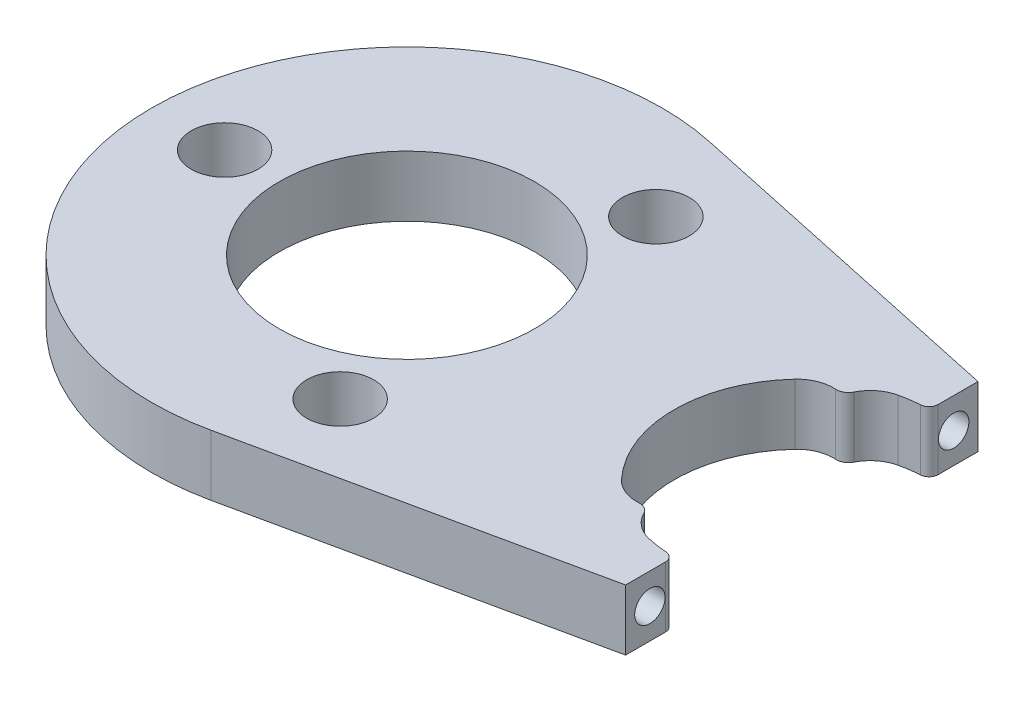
ISO-10303-21;
HEADER;
FILE_DESCRIPTION(('STEP AP214'),'2;1');
FILE_NAME('part.step','',(''),(''),'','','');
FILE_SCHEMA(('AUTOMOTIVE_DESIGN { 1 0 10303 214 1 1 1 1 }'));
ENDSEC;
DATA;
#1=APPLICATION_CONTEXT('core data for automotive mechanical design processes');
#2=APPLICATION_PROTOCOL_DEFINITION('international standard','automotive_design',2000,#1);
#3=PRODUCT_CONTEXT('',#1,'mechanical');
#4=PRODUCT('Part','Part','',(#3));
#5=PRODUCT_RELATED_PRODUCT_CATEGORY('part','',(#4));
#6=PRODUCT_DEFINITION_FORMATION('','',#4);
#7=PRODUCT_DEFINITION_CONTEXT('part definition',#1,'design');
#8=PRODUCT_DEFINITION('design','',#6,#7);
#9=PRODUCT_DEFINITION_SHAPE('','',#8);
#10=(LENGTH_UNIT() NAMED_UNIT(*) SI_UNIT(.MILLI.,.METRE.));
#11=(NAMED_UNIT(*) PLANE_ANGLE_UNIT() SI_UNIT($,.RADIAN.));
#12=(NAMED_UNIT(*) SI_UNIT($,.STERADIAN.) SOLID_ANGLE_UNIT());
#13=UNCERTAINTY_MEASURE_WITH_UNIT(LENGTH_MEASURE(1.E-05),#10,'distance_accuracy_value','');
#14=(GEOMETRIC_REPRESENTATION_CONTEXT(3) GLOBAL_UNCERTAINTY_ASSIGNED_CONTEXT((#13)) GLOBAL_UNIT_ASSIGNED_CONTEXT((#10,
#11,#12)) REPRESENTATION_CONTEXT('',''));
#15=CARTESIAN_POINT('',(0.,0.,0.));
#16=DIRECTION('',(0.,0.,1.));
#17=DIRECTION('',(1.,0.,0.));
#18=AXIS2_PLACEMENT_3D('',#15,#16,#17);
#19=CARTESIAN_POINT('',(32.5,2.5,0.));
#20=DIRECTION('',(0.,1.,0.));
#21=DIRECTION('',(0.,0.,1.));
#22=AXIS2_PLACEMENT_3D('',#19,#20,#21);
#23=PLANE('',#22);
#24=CARTESIAN_POINT('',(7.49999999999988,2.5,-12.9903810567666));
#25=DIRECTION('',(0.,1.,0.));
#26=DIRECTION('',(0.,0.,1.));
#27=AXIS2_PLACEMENT_3D('',#24,#25,#26);
#28=CIRCLE('',#27,2.75);
#29=CARTESIAN_POINT('',(7.49999999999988,2.5,-10.2403810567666));
#30=VERTEX_POINT('',#29);
#31=EDGE_CURVE('E610',#30,#30,#28,.T.);
#32=ORIENTED_EDGE('',*,*,#31,.F.);
#33=EDGE_LOOP('',(#32));
#34=FACE_BOUND('',#33,.T.);
#35=CARTESIAN_POINT('',(7.50000000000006,2.5,12.9903810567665));
#36=DIRECTION('',(0.,1.,0.));
#37=DIRECTION('',(0.,0.,1.));
#38=AXIS2_PLACEMENT_3D('',#35,#36,#37);
#39=CIRCLE('',#38,2.75);
#40=CARTESIAN_POINT('',(7.50000000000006,2.5,15.7403810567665));
#41=VERTEX_POINT('',#40);
#42=EDGE_CURVE('E612',#41,#41,#39,.T.);
#43=ORIENTED_EDGE('',*,*,#42,.F.);
#44=EDGE_LOOP('',(#43));
#45=FACE_BOUND('',#44,.T.);
#46=CARTESIAN_POINT('',(-15.,2.5,0.));
#47=DIRECTION('',(0.,1.,0.));
#48=DIRECTION('',(0.,0.,1.));
#49=AXIS2_PLACEMENT_3D('',#46,#47,#48);
#50=CIRCLE('',#49,2.75);
#51=CARTESIAN_POINT('',(-15.,2.5,2.75));
#52=VERTEX_POINT('',#51);
#53=EDGE_CURVE('E620',#52,#52,#50,.T.);
#54=ORIENTED_EDGE('',*,*,#53,.F.);
#55=EDGE_LOOP('',(#54));
#56=FACE_BOUND('',#55,.T.);
#57=CARTESIAN_POINT('',(27.25,2.5,-9.09326673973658));
#58=DIRECTION('',(0.,1.,0.));
#59=DIRECTION('',(0.,0.,1.));
#60=AXIS2_PLACEMENT_3D('',#57,#58,#59);
#61=CIRCLE('',#60,0.999999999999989);
#62=CARTESIAN_POINT('',(27.1879531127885,2.5,-8.09519350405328));
#63=VERTEX_POINT('',#62);
#64=CARTESIAN_POINT('',(28.1453802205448,2.5,-8.64796430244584));
#65=VERTEX_POINT('',#64);
#66=EDGE_CURVE('E193',#63,#65,#61,.T.);
#67=ORIENTED_EDGE('',*,*,#66,.T.);
#68=CARTESIAN_POINT('',(30.8315208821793,2.5,-7.3120569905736));
#69=DIRECTION('',(0.,1.,0.));
#70=DIRECTION('',(0.,0.,1.));
#71=AXIS2_PLACEMENT_3D('',#68,#69,#70);
#72=CIRCLE('',#71,3.);
#73=CARTESIAN_POINT('',(30.164129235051,2.5,-10.236879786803));
#74=VERTEX_POINT('',#73);
#75=EDGE_CURVE('E11',#65,#74,#72,.F.);
#76=ORIENTED_EDGE('',*,*,#75,.T.);
#77=CARTESIAN_POINT('',(32.5,2.5,0.));
#78=DIRECTION('',(0.,-1.,0.));
#79=DIRECTION('',(0.,0.,1.));
#80=AXIS2_PLACEMENT_3D('',#77,#78,#79);
#81=CIRCLE('',#80,10.5);
#82=CARTESIAN_POINT('',(31.8,2.5,-10.476640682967));
#83=VERTEX_POINT('',#82);
#84=EDGE_CURVE('E195',#74,#83,#81,.T.);
#85=ORIENTED_EDGE('',*,*,#84,.T.);
#86=CARTESIAN_POINT('',(31.75,2.5,-11.2249721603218));
#87=DIRECTION('',(0.,1.,0.));
#88=DIRECTION('',(0.,0.,1.));
#89=AXIS2_PLACEMENT_3D('',#86,#87,#88);
#90=CIRCLE('',#89,0.75);
#91=CARTESIAN_POINT('',(32.5,2.5,-11.2249721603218));
#92=VERTEX_POINT('',#91);
#93=EDGE_CURVE('E256',#83,#92,#90,.T.);
#94=ORIENTED_EDGE('',*,*,#93,.T.);
#95=DIRECTION('',(0.,0.,-1.));
#96=VECTOR('',#95,1.);
#97=CARTESIAN_POINT('',(32.5,2.5,-10.5));
#98=LINE('',#97,#96);
#99=CARTESIAN_POINT('',(32.5,2.5,-14.5));
#100=VERTEX_POINT('',#99);
#101=EDGE_CURVE('E197',#92,#100,#98,.T.);
#102=ORIENTED_EDGE('',*,*,#101,.T.);
#103=DIRECTION('',(-0.97771359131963,0.,-0.209943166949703));
#104=VECTOR('',#103,1.);
#105=CARTESIAN_POINT('',(4.40880650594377,2.5,-20.5319854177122));
#106=LINE('',#105,#104);
#107=CARTESIAN_POINT('',(4.40880650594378,2.5,-20.5319854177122));
#108=VERTEX_POINT('',#107);
#109=EDGE_CURVE('E199',#100,#108,#106,.T.);
#110=ORIENTED_EDGE('',*,*,#109,.T.);
#111=CARTESIAN_POINT('',(0.,2.5,0.));
#112=DIRECTION('',(0.,1.,0.));
#113=DIRECTION('',(0.,0.,1.));
#114=AXIS2_PLACEMENT_3D('',#111,#112,#113);
#115=CIRCLE('',#114,21.);
#116=CARTESIAN_POINT('',(4.40880650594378,2.5,20.5319854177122));
#117=VERTEX_POINT('',#116);
#118=EDGE_CURVE('E201',#108,#117,#115,.T.);
#119=ORIENTED_EDGE('',*,*,#118,.T.);
#120=DIRECTION('',(0.97771359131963,0.,-0.209943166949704));
#121=VECTOR('',#120,1.);
#122=CARTESIAN_POINT('',(32.5,2.5,14.5));
#123=LINE('',#122,#121);
#124=CARTESIAN_POINT('',(32.5,2.5,14.5));
#125=VERTEX_POINT('',#124);
#126=EDGE_CURVE('E203',#117,#125,#123,.T.);
#127=ORIENTED_EDGE('',*,*,#126,.T.);
#128=DIRECTION('',(0.,0.,-1.));
#129=VECTOR('',#128,1.);
#130=CARTESIAN_POINT('',(32.5,2.5,10.5));
#131=LINE('',#130,#129);
#132=CARTESIAN_POINT('',(32.5,2.5,11.2249721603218));
#133=VERTEX_POINT('',#132);
#134=EDGE_CURVE('E205',#125,#133,#131,.T.);
#135=ORIENTED_EDGE('',*,*,#134,.T.);
#136=CARTESIAN_POINT('',(31.75,2.5,11.2249721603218));
#137=DIRECTION('',(0.,1.,0.));
#138=DIRECTION('',(0.,0.,1.));
#139=AXIS2_PLACEMENT_3D('',#136,#137,#138);
#140=CIRCLE('',#139,0.75);
#141=CARTESIAN_POINT('',(31.8,2.5,10.476640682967));
#142=VERTEX_POINT('',#141);
#143=EDGE_CURVE('E254',#133,#142,#140,.T.);
#144=ORIENTED_EDGE('',*,*,#143,.T.);
#145=CARTESIAN_POINT('',(32.5,2.5,0.));
#146=DIRECTION('',(0.,-1.,0.));
#147=DIRECTION('',(0.,0.,1.));
#148=AXIS2_PLACEMENT_3D('',#145,#146,#147);
#149=CIRCLE('',#148,10.5);
#150=CARTESIAN_POINT('',(30.164129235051,2.5,10.236879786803));
#151=VERTEX_POINT('',#150);
#152=EDGE_CURVE('E183',#142,#151,#149,.T.);
#153=ORIENTED_EDGE('',*,*,#152,.T.);
#154=CARTESIAN_POINT('',(30.8315208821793,2.5,7.3120569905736));
#155=DIRECTION('',(0.,1.,0.));
#156=DIRECTION('',(0.,0.,1.));
#157=AXIS2_PLACEMENT_3D('',#154,#155,#156);
#158=CIRCLE('',#157,3.);
#159=CARTESIAN_POINT('',(28.1453802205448,2.5,8.64796430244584));
#160=VERTEX_POINT('',#159);
#161=EDGE_CURVE('E288',#151,#160,#158,.F.);
#162=ORIENTED_EDGE('',*,*,#161,.T.);
#163=CARTESIAN_POINT('',(27.25,2.5,9.09326673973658));
#164=DIRECTION('',(0.,1.,0.));
#165=DIRECTION('',(0.,0.,1.));
#166=AXIS2_PLACEMENT_3D('',#163,#164,#165);
#167=CIRCLE('',#166,0.999999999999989);
#168=CARTESIAN_POINT('',(27.1879531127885,2.5,8.09519350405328));
#169=VERTEX_POINT('',#168);
#170=EDGE_CURVE('E186',#160,#169,#167,.T.);
#171=ORIENTED_EDGE('',*,*,#170,.T.);
#172=CARTESIAN_POINT('',(27.001812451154,2.5,5.10097379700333));
#173=DIRECTION('',(0.,1.,0.));
#174=DIRECTION('',(0.,0.,1.));
#175=AXIS2_PLACEMENT_3D('',#172,#173,#174);
#176=CIRCLE('',#175,3.);
#177=CARTESIAN_POINT('',(24.8025374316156,2.5,7.14136331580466));
#178=VERTEX_POINT('',#177);
#179=EDGE_CURVE('E284',#169,#178,#176,.F.);
#180=ORIENTED_EDGE('',*,*,#179,.T.);
#181=CARTESIAN_POINT('',(32.5,2.5,0.));
#182=DIRECTION('',(0.,-1.,0.));
#183=DIRECTION('',(0.,0.,1.));
#184=AXIS2_PLACEMENT_3D('',#181,#182,#183);
#185=CIRCLE('',#184,10.5);
#186=CARTESIAN_POINT('',(24.8025374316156,2.5,-7.14136331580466));
#187=VERTEX_POINT('',#186);
#188=EDGE_CURVE('E190',#178,#187,#185,.T.);
#189=ORIENTED_EDGE('',*,*,#188,.T.);
#190=CARTESIAN_POINT('',(27.001812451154,2.5,-5.10097379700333));
#191=DIRECTION('',(0.,1.,0.));
#192=DIRECTION('',(0.,0.,1.));
#193=AXIS2_PLACEMENT_3D('',#190,#191,#192);
#194=CIRCLE('',#193,3.);
#195=EDGE_CURVE('E292',#187,#63,#194,.F.);
#196=ORIENTED_EDGE('',*,*,#195,.T.);
#197=EDGE_LOOP('',(#67,#76,#85,#94,#102,#110,#119,#127,#135,#144,#153,#162,#171,#180,#189,#196));
#198=FACE_BOUND('',#197,.T.);
#199=CARTESIAN_POINT('',(0.,2.5,0.));
#200=DIRECTION('',(0.,1.,0.));
#201=DIRECTION('',(0.,0.,1.));
#202=AXIS2_PLACEMENT_3D('',#199,#200,#201);
#203=CIRCLE('',#202,10.5);
#204=CARTESIAN_POINT('',(0.,2.5,10.5));
#205=VERTEX_POINT('',#204);
#206=EDGE_CURVE('E177',#205,#205,#203,.T.);
#207=ORIENTED_EDGE('',*,*,#206,.F.);
#208=EDGE_LOOP('',(#207));
#209=FACE_BOUND('',#208,.T.);
#210=ADVANCED_FACE('F37',(#34,#45,#56,#198,#209),#23,.T.);
#211=CARTESIAN_POINT('',(32.5,-2.5,0.));
#212=DIRECTION('',(0.,1.,0.));
#213=DIRECTION('',(0.,0.,1.));
#214=AXIS2_PLACEMENT_3D('',#211,#212,#213);
#215=PLANE('',#214);
#216=CARTESIAN_POINT('',(7.49999999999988,-2.5,-12.9903810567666));
#217=DIRECTION('',(0.,1.,0.));
#218=DIRECTION('',(0.,0.,1.));
#219=AXIS2_PLACEMENT_3D('',#216,#217,#218);
#220=CIRCLE('',#219,2.75);
#221=CARTESIAN_POINT('',(7.49999999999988,-2.5,-10.2403810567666));
#222=VERTEX_POINT('',#221);
#223=EDGE_CURVE('E608',#222,#222,#220,.T.);
#224=ORIENTED_EDGE('',*,*,#223,.T.);
#225=EDGE_LOOP('',(#224));
#226=FACE_BOUND('',#225,.T.);
#227=CARTESIAN_POINT('',(7.50000000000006,-2.5,12.9903810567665));
#228=DIRECTION('',(0.,1.,0.));
#229=DIRECTION('',(0.,0.,1.));
#230=AXIS2_PLACEMENT_3D('',#227,#228,#229);
#231=CIRCLE('',#230,2.75);
#232=CARTESIAN_POINT('',(7.50000000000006,-2.5,15.7403810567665));
#233=VERTEX_POINT('',#232);
#234=EDGE_CURVE('E617',#233,#233,#231,.T.);
#235=ORIENTED_EDGE('',*,*,#234,.T.);
#236=EDGE_LOOP('',(#235));
#237=FACE_BOUND('',#236,.T.);
#238=CARTESIAN_POINT('',(-15.,-2.5,0.));
#239=DIRECTION('',(0.,1.,0.));
#240=DIRECTION('',(0.,0.,1.));
#241=AXIS2_PLACEMENT_3D('',#238,#239,#240);
#242=CIRCLE('',#241,2.75);
#243=CARTESIAN_POINT('',(-15.,-2.5,2.75));
#244=VERTEX_POINT('',#243);
#245=EDGE_CURVE('E170',#244,#244,#242,.T.);
#246=ORIENTED_EDGE('',*,*,#245,.T.);
#247=EDGE_LOOP('',(#246));
#248=FACE_BOUND('',#247,.T.);
#249=DIRECTION('',(0.,0.,-1.));
#250=VECTOR('',#249,1.);
#251=CARTESIAN_POINT('',(32.5,-2.5,-10.5));
#252=LINE('',#251,#250);
#253=CARTESIAN_POINT('',(32.5,-2.5,-11.2249721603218));
#254=VERTEX_POINT('',#253);
#255=CARTESIAN_POINT('',(32.5,-2.5,-14.5));
#256=VERTEX_POINT('',#255);
#257=EDGE_CURVE('E222',#254,#256,#252,.T.);
#258=ORIENTED_EDGE('',*,*,#257,.F.);
#259=CARTESIAN_POINT('',(31.75,-2.5,-11.2249721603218));
#260=DIRECTION('',(0.,1.,0.));
#261=DIRECTION('',(0.,0.,1.));
#262=AXIS2_PLACEMENT_3D('',#259,#260,#261);
#263=CIRCLE('',#262,0.75);
#264=CARTESIAN_POINT('',(31.8,-2.5,-10.476640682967));
#265=VERTEX_POINT('',#264);
#266=EDGE_CURVE('E248',#254,#265,#263,.F.);
#267=ORIENTED_EDGE('',*,*,#266,.T.);
#268=CARTESIAN_POINT('',(32.5,-2.5,0.));
#269=DIRECTION('',(0.,-1.,0.));
#270=DIRECTION('',(0.,0.,1.));
#271=AXIS2_PLACEMENT_3D('',#268,#269,#270);
#272=CIRCLE('',#271,10.5);
#273=CARTESIAN_POINT('',(30.164129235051,-2.5,-10.236879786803));
#274=VERTEX_POINT('',#273);
#275=EDGE_CURVE('E220',#274,#265,#272,.T.);
#276=ORIENTED_EDGE('',*,*,#275,.F.);
#277=CARTESIAN_POINT('',(30.8315208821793,-2.5,-7.3120569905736));
#278=DIRECTION('',(0.,1.,0.));
#279=DIRECTION('',(0.,0.,1.));
#280=AXIS2_PLACEMENT_3D('',#277,#278,#279);
#281=CIRCLE('',#280,3.);
#282=CARTESIAN_POINT('',(28.1453802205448,-2.5,-8.64796430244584));
#283=VERTEX_POINT('',#282);
#284=EDGE_CURVE('E45',#274,#283,#281,.T.);
#285=ORIENTED_EDGE('',*,*,#284,.T.);
#286=CARTESIAN_POINT('',(27.25,-2.5,-9.09326673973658));
#287=DIRECTION('',(0.,1.,0.));
#288=DIRECTION('',(0.,0.,1.));
#289=AXIS2_PLACEMENT_3D('',#286,#287,#288);
#290=CIRCLE('',#289,0.999999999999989);
#291=CARTESIAN_POINT('',(27.1879531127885,-2.5,-8.09519350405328));
#292=VERTEX_POINT('',#291);
#293=EDGE_CURVE('E217',#292,#283,#290,.T.);
#294=ORIENTED_EDGE('',*,*,#293,.F.);
#295=CARTESIAN_POINT('',(27.001812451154,-2.5,-5.10097379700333));
#296=DIRECTION('',(0.,1.,0.));
#297=DIRECTION('',(0.,0.,1.));
#298=AXIS2_PLACEMENT_3D('',#295,#296,#297);
#299=CIRCLE('',#298,3.);
#300=CARTESIAN_POINT('',(24.8025374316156,-2.5,-7.14136331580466));
#301=VERTEX_POINT('',#300);
#302=EDGE_CURVE('E290',#292,#301,#299,.T.);
#303=ORIENTED_EDGE('',*,*,#302,.T.);
#304=CARTESIAN_POINT('',(32.5,-2.5,0.));
#305=DIRECTION('',(0.,-1.,0.));
#306=DIRECTION('',(0.,0.,1.));
#307=AXIS2_PLACEMENT_3D('',#304,#305,#306);
#308=CIRCLE('',#307,10.5);
#309=CARTESIAN_POINT('',(24.8025374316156,-2.5,7.14136331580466));
#310=VERTEX_POINT('',#309);
#311=EDGE_CURVE('E214',#310,#301,#308,.T.);
#312=ORIENTED_EDGE('',*,*,#311,.F.);
#313=CARTESIAN_POINT('',(27.001812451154,-2.5,5.10097379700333));
#314=DIRECTION('',(0.,1.,0.));
#315=DIRECTION('',(0.,0.,1.));
#316=AXIS2_PLACEMENT_3D('',#313,#314,#315);
#317=CIRCLE('',#316,3.);
#318=CARTESIAN_POINT('',(27.1879531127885,-2.5,8.09519350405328));
#319=VERTEX_POINT('',#318);
#320=EDGE_CURVE('E282',#310,#319,#317,.T.);
#321=ORIENTED_EDGE('',*,*,#320,.T.);
#322=CARTESIAN_POINT('',(27.25,-2.5,9.09326673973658));
#323=DIRECTION('',(0.,1.,0.));
#324=DIRECTION('',(0.,0.,1.));
#325=AXIS2_PLACEMENT_3D('',#322,#323,#324);
#326=CIRCLE('',#325,0.999999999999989);
#327=CARTESIAN_POINT('',(28.1453802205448,-2.5,8.64796430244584));
#328=VERTEX_POINT('',#327);
#329=EDGE_CURVE('E211',#328,#319,#326,.T.);
#330=ORIENTED_EDGE('',*,*,#329,.F.);
#331=CARTESIAN_POINT('',(30.8315208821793,-2.5,7.3120569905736));
#332=DIRECTION('',(0.,1.,0.));
#333=DIRECTION('',(0.,0.,1.));
#334=AXIS2_PLACEMENT_3D('',#331,#332,#333);
#335=CIRCLE('',#334,3.);
#336=CARTESIAN_POINT('',(30.164129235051,-2.5,10.236879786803));
#337=VERTEX_POINT('',#336);
#338=EDGE_CURVE('E286',#328,#337,#335,.T.);
#339=ORIENTED_EDGE('',*,*,#338,.T.);
#340=CARTESIAN_POINT('',(32.5,-2.5,0.));
#341=DIRECTION('',(0.,-1.,0.));
#342=DIRECTION('',(0.,0.,1.));
#343=AXIS2_PLACEMENT_3D('',#340,#341,#342);
#344=CIRCLE('',#343,10.5);
#345=CARTESIAN_POINT('',(31.8,-2.5,10.476640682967));
#346=VERTEX_POINT('',#345);
#347=EDGE_CURVE('E180',#346,#337,#344,.T.);
#348=ORIENTED_EDGE('',*,*,#347,.F.);
#349=CARTESIAN_POINT('',(31.75,-2.5,11.2249721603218));
#350=DIRECTION('',(0.,1.,0.));
#351=DIRECTION('',(0.,0.,1.));
#352=AXIS2_PLACEMENT_3D('',#349,#350,#351);
#353=CIRCLE('',#352,0.75);
#354=CARTESIAN_POINT('',(32.5,-2.5,11.2249721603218));
#355=VERTEX_POINT('',#354);
#356=EDGE_CURVE('E246',#346,#355,#353,.F.);
#357=ORIENTED_EDGE('',*,*,#356,.T.);
#358=DIRECTION('',(0.,0.,-1.));
#359=VECTOR('',#358,1.);
#360=CARTESIAN_POINT('',(32.5,-2.5,10.5));
#361=LINE('',#360,#359);
#362=CARTESIAN_POINT('',(32.5,-2.5,14.5));
#363=VERTEX_POINT('',#362);
#364=EDGE_CURVE('E187',#363,#355,#361,.T.);
#365=ORIENTED_EDGE('',*,*,#364,.F.);
#366=DIRECTION('',(0.97771359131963,0.,-0.209943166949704));
#367=VECTOR('',#366,1.);
#368=CARTESIAN_POINT('',(32.5,-2.5,14.5));
#369=LINE('',#368,#367);
#370=CARTESIAN_POINT('',(4.40880650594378,-2.5,20.5319854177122));
#371=VERTEX_POINT('',#370);
#372=EDGE_CURVE('E228',#371,#363,#369,.T.);
#373=ORIENTED_EDGE('',*,*,#372,.F.);
#374=CARTESIAN_POINT('',(0.,-2.5,0.));
#375=DIRECTION('',(0.,1.,0.));
#376=DIRECTION('',(0.,0.,1.));
#377=AXIS2_PLACEMENT_3D('',#374,#375,#376);
#378=CIRCLE('',#377,21.);
#379=CARTESIAN_POINT('',(4.40880650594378,-2.5,-20.5319854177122));
#380=VERTEX_POINT('',#379);
#381=EDGE_CURVE('E226',#380,#371,#378,.T.);
#382=ORIENTED_EDGE('',*,*,#381,.F.);
#383=DIRECTION('',(-0.97771359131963,0.,-0.209943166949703));
#384=VECTOR('',#383,1.);
#385=CARTESIAN_POINT('',(4.40880650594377,-2.5,-20.5319854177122));
#386=LINE('',#385,#384);
#387=EDGE_CURVE('E224',#256,#380,#386,.T.);
#388=ORIENTED_EDGE('',*,*,#387,.F.);
#389=EDGE_LOOP('',(#258,#267,#276,#285,#294,#303,#312,#321,#330,#339,#348,#357,#365,#373,#382,#388));
#390=FACE_BOUND('',#389,.T.);
#391=CARTESIAN_POINT('',(0.,-2.5,0.));
#392=DIRECTION('',(0.,1.,0.));
#393=DIRECTION('',(0.,0.,1.));
#394=AXIS2_PLACEMENT_3D('',#391,#392,#393);
#395=CIRCLE('',#394,10.5);
#396=CARTESIAN_POINT('',(0.,-2.5,10.5));
#397=VERTEX_POINT('',#396);
#398=EDGE_CURVE('E176',#397,#397,#395,.T.);
#399=ORIENTED_EDGE('',*,*,#398,.T.);
#400=EDGE_LOOP('',(#399));
#401=FACE_BOUND('',#400,.T.);
#402=ADVANCED_FACE('F297',(#226,#237,#248,#390,#401),#215,.F.);
#403=CARTESIAN_POINT('',(32.5,2.5,0.));
#404=DIRECTION('',(0.,-1.,0.));
#405=DIRECTION('',(0.,0.,-1.));
#406=AXIS2_PLACEMENT_3D('',#403,#404,#405);
#407=CYLINDRICAL_SURFACE('',#406,10.5);
#408=ORIENTED_EDGE('',*,*,#347,.T.);
#409=DIRECTION('',(0.,-1.,0.));
#410=VECTOR('',#409,1.);
#411=CARTESIAN_POINT('',(30.164129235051,2.5,10.236879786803));
#412=LINE('',#411,#410);
#413=EDGE_CURVE('E273',#337,#151,#412,.F.);
#414=ORIENTED_EDGE('',*,*,#413,.T.);
#415=ORIENTED_EDGE('',*,*,#152,.F.);
#416=DIRECTION('',(0.,-1.,0.));
#417=VECTOR('',#416,1.);
#418=CARTESIAN_POINT('',(31.8,2.5,10.476640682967));
#419=LINE('',#418,#417);
#420=EDGE_CURVE('E258',#142,#346,#419,.T.);
#421=ORIENTED_EDGE('',*,*,#420,.T.);
#422=EDGE_LOOP('',(#408,#414,#415,#421));
#423=FACE_BOUND('',#422,.T.);
#424=ADVANCED_FACE('F342',(#423),#407,.F.);
#425=CARTESIAN_POINT('',(27.25,2.5,9.09326673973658));
#426=DIRECTION('',(0.,-1.,0.));
#427=DIRECTION('',(0.,0.,-1.));
#428=AXIS2_PLACEMENT_3D('',#425,#426,#427);
#429=CYLINDRICAL_SURFACE('',#428,0.999999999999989);
#430=ORIENTED_EDGE('',*,*,#329,.T.);
#431=DIRECTION('',(0.,-1.,0.));
#432=VECTOR('',#431,1.);
#433=CARTESIAN_POINT('',(27.1879531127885,2.5,8.09519350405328));
#434=LINE('',#433,#432);
#435=EDGE_CURVE('E271',#319,#169,#434,.F.);
#436=ORIENTED_EDGE('',*,*,#435,.T.);
#437=ORIENTED_EDGE('',*,*,#170,.F.);
#438=DIRECTION('',(0.,-1.,0.));
#439=VECTOR('',#438,1.);
#440=CARTESIAN_POINT('',(28.1453802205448,2.5,8.64796430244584));
#441=LINE('',#440,#439);
#442=EDGE_CURVE('E268',#160,#328,#441,.T.);
#443=ORIENTED_EDGE('',*,*,#442,.T.);
#444=EDGE_LOOP('',(#430,#436,#437,#443));
#445=FACE_BOUND('',#444,.T.);
#446=ADVANCED_FACE('F351',(#445),#429,.T.);
#447=CARTESIAN_POINT('',(32.5,2.5,0.));
#448=DIRECTION('',(0.,-1.,0.));
#449=DIRECTION('',(0.,0.,-1.));
#450=AXIS2_PLACEMENT_3D('',#447,#448,#449);
#451=CYLINDRICAL_SURFACE('',#450,10.5);
#452=ORIENTED_EDGE('',*,*,#188,.F.);
#453=DIRECTION('',(0.,-1.,0.));
#454=VECTOR('',#453,1.);
#455=CARTESIAN_POINT('',(24.8025374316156,2.5,7.14136331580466));
#456=LINE('',#455,#454);
#457=EDGE_CURVE('E265',#178,#310,#456,.T.);
#458=ORIENTED_EDGE('',*,*,#457,.T.);
#459=ORIENTED_EDGE('',*,*,#311,.T.);
#460=DIRECTION('',(0.,-1.,0.));
#461=VECTOR('',#460,1.);
#462=CARTESIAN_POINT('',(24.8025374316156,2.5,-7.14136331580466));
#463=LINE('',#462,#461);
#464=EDGE_CURVE('E263',#301,#187,#463,.F.);
#465=ORIENTED_EDGE('',*,*,#464,.T.);
#466=EDGE_LOOP('',(#452,#458,#459,#465));
#467=FACE_BOUND('',#466,.T.);
#468=ADVANCED_FACE('F360',(#467),#451,.F.);
#469=CARTESIAN_POINT('',(27.25,2.5,-9.09326673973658));
#470=DIRECTION('',(0.,-1.,0.));
#471=DIRECTION('',(0.,0.,-1.));
#472=AXIS2_PLACEMENT_3D('',#469,#470,#471);
#473=CYLINDRICAL_SURFACE('',#472,0.999999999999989);
#474=ORIENTED_EDGE('',*,*,#66,.F.);
#475=DIRECTION('',(0.,-1.,0.));
#476=VECTOR('',#475,1.);
#477=CARTESIAN_POINT('',(27.1879531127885,2.5,-8.09519350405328));
#478=LINE('',#477,#476);
#479=EDGE_CURVE('E277',#63,#292,#478,.T.);
#480=ORIENTED_EDGE('',*,*,#479,.T.);
#481=ORIENTED_EDGE('',*,*,#293,.T.);
#482=DIRECTION('',(0.,-1.,0.));
#483=VECTOR('',#482,1.);
#484=CARTESIAN_POINT('',(28.1453802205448,2.5,-8.64796430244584));
#485=LINE('',#484,#483);
#486=EDGE_CURVE('E275',#283,#65,#485,.F.);
#487=ORIENTED_EDGE('',*,*,#486,.T.);
#488=EDGE_LOOP('',(#474,#480,#481,#487));
#489=FACE_BOUND('',#488,.T.);
#490=ADVANCED_FACE('F301',(#489),#473,.T.);
#491=CARTESIAN_POINT('',(32.5,2.5,0.));
#492=DIRECTION('',(0.,-1.,0.));
#493=DIRECTION('',(0.,0.,-1.));
#494=AXIS2_PLACEMENT_3D('',#491,#492,#493);
#495=CYLINDRICAL_SURFACE('',#494,10.5);
#496=ORIENTED_EDGE('',*,*,#84,.F.);
#497=DIRECTION('',(0.,-1.,0.));
#498=VECTOR('',#497,1.);
#499=CARTESIAN_POINT('',(30.164129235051,2.5,-10.236879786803));
#500=LINE('',#499,#498);
#501=EDGE_CURVE('E280',#74,#274,#500,.T.);
#502=ORIENTED_EDGE('',*,*,#501,.T.);
#503=ORIENTED_EDGE('',*,*,#275,.T.);
#504=DIRECTION('',(0.,-1.,0.));
#505=VECTOR('',#504,1.);
#506=CARTESIAN_POINT('',(31.8,2.5,-10.476640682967));
#507=LINE('',#506,#505);
#508=EDGE_CURVE('E251',#265,#83,#507,.F.);
#509=ORIENTED_EDGE('',*,*,#508,.T.);
#510=EDGE_LOOP('',(#496,#502,#503,#509));
#511=FACE_BOUND('',#510,.T.);
#512=ADVANCED_FACE('F304',(#511),#495,.F.);
#513=CARTESIAN_POINT('',(32.5,2.5,-10.5));
#514=DIRECTION('',(-1.,0.,0.));
#515=DIRECTION('',(0.,0.,1.));
#516=AXIS2_PLACEMENT_3D('',#513,#514,#515);
#517=PLANE('',#516);
#518=CARTESIAN_POINT('',(32.5,0.,-12.5));
#519=DIRECTION('',(1.,0.,0.));
#520=DIRECTION('',(0.,0.,-1.));
#521=AXIS2_PLACEMENT_3D('',#518,#519,#520);
#522=CIRCLE('',#521,1.24999999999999);
#523=CARTESIAN_POINT('',(32.5,0.,-13.75));
#524=VERTEX_POINT('',#523);
#525=EDGE_CURVE('E163',#524,#524,#522,.T.);
#526=ORIENTED_EDGE('',*,*,#525,.F.);
#527=EDGE_LOOP('',(#526));
#528=FACE_BOUND('',#527,.T.);
#529=ORIENTED_EDGE('',*,*,#101,.F.);
#530=DIRECTION('',(0.,-1.,0.));
#531=VECTOR('',#530,1.);
#532=CARTESIAN_POINT('',(32.5,2.5,-11.2249721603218));
#533=LINE('',#532,#531);
#534=EDGE_CURVE('E243',#92,#254,#533,.T.);
#535=ORIENTED_EDGE('',*,*,#534,.T.);
#536=ORIENTED_EDGE('',*,*,#257,.T.);
#537=DIRECTION('',(0.,-1.,0.));
#538=VECTOR('',#537,1.);
#539=CARTESIAN_POINT('',(32.5,2.5,-14.5));
#540=LINE('',#539,#538);
#541=EDGE_CURVE('E240',#100,#256,#540,.T.);
#542=ORIENTED_EDGE('',*,*,#541,.F.);
#543=EDGE_LOOP('',(#529,#535,#536,#542));
#544=FACE_BOUND('',#543,.T.);
#545=ADVANCED_FACE('F313',(#528,#544),#517,.F.);
#546=CARTESIAN_POINT('',(4.40880650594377,2.5,-20.5319854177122));
#547=DIRECTION('',(-0.209943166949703,0.,0.97771359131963));
#548=DIRECTION('',(0.97771359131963,0.,0.209943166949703));
#549=AXIS2_PLACEMENT_3D('',#546,#547,#548);
#550=PLANE('',#549);
#551=ORIENTED_EDGE('',*,*,#387,.T.);
#552=DIRECTION('',(0.,-1.,0.));
#553=VECTOR('',#552,1.);
#554=CARTESIAN_POINT('',(4.40880650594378,2.5,-20.5319854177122));
#555=LINE('',#554,#553);
#556=EDGE_CURVE('E237',#108,#380,#555,.T.);
#557=ORIENTED_EDGE('',*,*,#556,.F.);
#558=ORIENTED_EDGE('',*,*,#109,.F.);
#559=ORIENTED_EDGE('',*,*,#541,.T.);
#560=EDGE_LOOP('',(#551,#557,#558,#559));
#561=FACE_BOUND('',#560,.T.);
#562=ADVANCED_FACE('F319',(#561),#550,.F.);
#563=CARTESIAN_POINT('',(0.,2.5,0.));
#564=DIRECTION('',(0.,-1.,0.));
#565=DIRECTION('',(0.,0.,-1.));
#566=AXIS2_PLACEMENT_3D('',#563,#564,#565);
#567=CYLINDRICAL_SURFACE('',#566,21.);
#568=ORIENTED_EDGE('',*,*,#381,.T.);
#569=DIRECTION('',(0.,-1.,0.));
#570=VECTOR('',#569,1.);
#571=CARTESIAN_POINT('',(4.40880650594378,2.5,20.5319854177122));
#572=LINE('',#571,#570);
#573=EDGE_CURVE('E234',#117,#371,#572,.T.);
#574=ORIENTED_EDGE('',*,*,#573,.F.);
#575=ORIENTED_EDGE('',*,*,#118,.F.);
#576=ORIENTED_EDGE('',*,*,#556,.T.);
#577=EDGE_LOOP('',(#568,#574,#575,#576));
#578=FACE_BOUND('',#577,.T.);
#579=ADVANCED_FACE('F326',(#578),#567,.T.);
#580=CARTESIAN_POINT('',(32.5,2.5,14.5));
#581=DIRECTION('',(-0.209943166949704,0.,-0.97771359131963));
#582=DIRECTION('',(-0.97771359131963,0.,0.209943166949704));
#583=AXIS2_PLACEMENT_3D('',#580,#581,#582);
#584=PLANE('',#583);
#585=ORIENTED_EDGE('',*,*,#372,.T.);
#586=DIRECTION('',(0.,-1.,0.));
#587=VECTOR('',#586,1.);
#588=CARTESIAN_POINT('',(32.5,2.5,14.5));
#589=LINE('',#588,#587);
#590=EDGE_CURVE('E208',#125,#363,#589,.T.);
#591=ORIENTED_EDGE('',*,*,#590,.F.);
#592=ORIENTED_EDGE('',*,*,#126,.F.);
#593=ORIENTED_EDGE('',*,*,#573,.T.);
#594=EDGE_LOOP('',(#585,#591,#592,#593));
#595=FACE_BOUND('',#594,.T.);
#596=ADVANCED_FACE('F329',(#595),#584,.F.);
#597=CARTESIAN_POINT('',(32.5,2.5,10.5));
#598=DIRECTION('',(-1.,0.,0.));
#599=DIRECTION('',(0.,0.,1.));
#600=AXIS2_PLACEMENT_3D('',#597,#598,#599);
#601=PLANE('',#600);
#602=CARTESIAN_POINT('',(32.5,0.,12.5));
#603=DIRECTION('',(1.,0.,0.));
#604=DIRECTION('',(0.,0.,-1.));
#605=AXIS2_PLACEMENT_3D('',#602,#603,#604);
#606=CIRCLE('',#605,1.24999999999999);
#607=CARTESIAN_POINT('',(32.5,0.,11.25));
#608=VERTEX_POINT('',#607);
#609=EDGE_CURVE('E164',#608,#608,#606,.T.);
#610=ORIENTED_EDGE('',*,*,#609,.F.);
#611=EDGE_LOOP('',(#610));
#612=FACE_BOUND('',#611,.T.);
#613=ORIENTED_EDGE('',*,*,#364,.T.);
#614=DIRECTION('',(0.,-1.,0.));
#615=VECTOR('',#614,1.);
#616=CARTESIAN_POINT('',(32.5,2.5,11.2249721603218));
#617=LINE('',#616,#615);
#618=EDGE_CURVE('E261',#355,#133,#617,.F.);
#619=ORIENTED_EDGE('',*,*,#618,.T.);
#620=ORIENTED_EDGE('',*,*,#134,.F.);
#621=ORIENTED_EDGE('',*,*,#590,.T.);
#622=EDGE_LOOP('',(#613,#619,#620,#621));
#623=FACE_BOUND('',#622,.T.);
#624=ADVANCED_FACE('F333',(#612,#623),#601,.F.);
#625=CARTESIAN_POINT('',(0.,2.5,0.));
#626=DIRECTION('',(0.,-1.,0.));
#627=DIRECTION('',(0.,0.,-1.));
#628=AXIS2_PLACEMENT_3D('',#625,#626,#627);
#629=CYLINDRICAL_SURFACE('',#628,10.5);
#630=ORIENTED_EDGE('',*,*,#206,.T.);
#631=EDGE_LOOP('',(#630));
#632=FACE_BOUND('',#631,.T.);
#633=ORIENTED_EDGE('',*,*,#398,.F.);
#634=EDGE_LOOP('',(#633));
#635=FACE_BOUND('',#634,.T.);
#636=ADVANCED_FACE('F383',(#632,#635),#629,.F.);
#637=CARTESIAN_POINT('',(25.,0.,-12.5));
#638=DIRECTION('',(1.,0.,0.));
#639=DIRECTION('',(0.,0.,-1.));
#640=AXIS2_PLACEMENT_3D('',#637,#638,#639);
#641=CONICAL_SURFACE('',#640,1.25,1.02974425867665);
#642=CARTESIAN_POINT('',(24.2489242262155,0.,-12.5));
#643=VERTEX_POINT('',#642);
#644=VERTEX_LOOP('',#643);
#645=FACE_BOUND('',#644,.T.);
#646=CARTESIAN_POINT('',(25.,0.,-12.5));
#647=DIRECTION('',(1.,0.,0.));
#648=DIRECTION('',(0.,0.,-1.));
#649=AXIS2_PLACEMENT_3D('',#646,#647,#648);
#650=CIRCLE('',#649,1.25);
#651=CARTESIAN_POINT('',(25.,0.,-13.75));
#652=VERTEX_POINT('',#651);
#653=EDGE_CURVE('E167',#652,#652,#650,.T.);
#654=ORIENTED_EDGE('',*,*,#653,.T.);
#655=EDGE_LOOP('',(#654));
#656=FACE_BOUND('',#655,.T.);
#657=ADVANCED_FACE('F484',(#645,#656),#641,.F.);
#658=CARTESIAN_POINT('',(32.5,0.,-12.5));
#659=DIRECTION('',(1.,0.,0.));
#660=DIRECTION('',(0.,0.,-1.));
#661=AXIS2_PLACEMENT_3D('',#658,#659,#660);
#662=CYLINDRICAL_SURFACE('',#661,1.24999999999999);
#663=ORIENTED_EDGE('',*,*,#653,.F.);
#664=EDGE_LOOP('',(#663));
#665=FACE_BOUND('',#664,.T.);
#666=ORIENTED_EDGE('',*,*,#525,.T.);
#667=EDGE_LOOP('',(#666));
#668=FACE_BOUND('',#667,.T.);
#669=ADVANCED_FACE('F157',(#665,#668),#662,.F.);
#670=CARTESIAN_POINT('',(25.,0.,12.5));
#671=DIRECTION('',(1.,0.,0.));
#672=DIRECTION('',(0.,0.,-1.));
#673=AXIS2_PLACEMENT_3D('',#670,#671,#672);
#674=CONICAL_SURFACE('',#673,1.25,1.02974425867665);
#675=CARTESIAN_POINT('',(24.2489242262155,0.,12.5));
#676=VERTEX_POINT('',#675);
#677=VERTEX_LOOP('',#676);
#678=FACE_BOUND('',#677,.T.);
#679=CARTESIAN_POINT('',(25.,0.,12.5));
#680=DIRECTION('',(1.,0.,0.));
#681=DIRECTION('',(0.,0.,-1.));
#682=AXIS2_PLACEMENT_3D('',#679,#680,#681);
#683=CIRCLE('',#682,1.25);
#684=CARTESIAN_POINT('',(25.,0.,11.25));
#685=VERTEX_POINT('',#684);
#686=EDGE_CURVE('E161',#685,#685,#683,.T.);
#687=ORIENTED_EDGE('',*,*,#686,.T.);
#688=EDGE_LOOP('',(#687));
#689=FACE_BOUND('',#688,.T.);
#690=ADVANCED_FACE('F153',(#678,#689),#674,.F.);
#691=CARTESIAN_POINT('',(32.5,0.,12.5));
#692=DIRECTION('',(1.,0.,0.));
#693=DIRECTION('',(0.,0.,-1.));
#694=AXIS2_PLACEMENT_3D('',#691,#692,#693);
#695=CYLINDRICAL_SURFACE('',#694,1.24999999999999);
#696=ORIENTED_EDGE('',*,*,#686,.F.);
#697=EDGE_LOOP('',(#696));
#698=FACE_BOUND('',#697,.T.);
#699=ORIENTED_EDGE('',*,*,#609,.T.);
#700=EDGE_LOOP('',(#699));
#701=FACE_BOUND('',#700,.T.);
#702=ADVANCED_FACE('F156',(#698,#701),#695,.F.);
#703=CARTESIAN_POINT('',(31.75,2.5,-11.2249721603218));
#704=DIRECTION('',(0.,-1.,0.));
#705=DIRECTION('',(0.,0.,-1.));
#706=AXIS2_PLACEMENT_3D('',#703,#704,#705);
#707=CYLINDRICAL_SURFACE('',#706,0.75);
#708=ORIENTED_EDGE('',*,*,#93,.F.);
#709=ORIENTED_EDGE('',*,*,#508,.F.);
#710=ORIENTED_EDGE('',*,*,#266,.F.);
#711=ORIENTED_EDGE('',*,*,#534,.F.);
#712=EDGE_LOOP('',(#708,#709,#710,#711));
#713=FACE_BOUND('',#712,.T.);
#714=ADVANCED_FACE('F315',(#713),#707,.T.);
#715=CARTESIAN_POINT('',(31.75,2.5,11.2249721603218));
#716=DIRECTION('',(0.,-1.,0.));
#717=DIRECTION('',(0.,0.,-1.));
#718=AXIS2_PLACEMENT_3D('',#715,#716,#717);
#719=CYLINDRICAL_SURFACE('',#718,0.75);
#720=ORIENTED_EDGE('',*,*,#143,.F.);
#721=ORIENTED_EDGE('',*,*,#618,.F.);
#722=ORIENTED_EDGE('',*,*,#356,.F.);
#723=ORIENTED_EDGE('',*,*,#420,.F.);
#724=EDGE_LOOP('',(#720,#721,#722,#723));
#725=FACE_BOUND('',#724,.T.);
#726=ADVANCED_FACE('F339',(#725),#719,.T.);
#727=CARTESIAN_POINT('',(27.001812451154,2.5,5.10097379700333));
#728=DIRECTION('',(0.,-1.,0.));
#729=DIRECTION('',(0.,0.,-1.));
#730=AXIS2_PLACEMENT_3D('',#727,#728,#729);
#731=CYLINDRICAL_SURFACE('',#730,3.);
#732=ORIENTED_EDGE('',*,*,#179,.F.);
#733=ORIENTED_EDGE('',*,*,#435,.F.);
#734=ORIENTED_EDGE('',*,*,#320,.F.);
#735=ORIENTED_EDGE('',*,*,#457,.F.);
#736=EDGE_LOOP('',(#732,#733,#734,#735));
#737=FACE_BOUND('',#736,.T.);
#738=ADVANCED_FACE('F357',(#737),#731,.F.);
#739=CARTESIAN_POINT('',(30.8315208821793,2.5,7.3120569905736));
#740=DIRECTION('',(0.,-1.,0.));
#741=DIRECTION('',(0.,0.,-1.));
#742=AXIS2_PLACEMENT_3D('',#739,#740,#741);
#743=CYLINDRICAL_SURFACE('',#742,3.);
#744=ORIENTED_EDGE('',*,*,#161,.F.);
#745=ORIENTED_EDGE('',*,*,#413,.F.);
#746=ORIENTED_EDGE('',*,*,#338,.F.);
#747=ORIENTED_EDGE('',*,*,#442,.F.);
#748=EDGE_LOOP('',(#744,#745,#746,#747));
#749=FACE_BOUND('',#748,.T.);
#750=ADVANCED_FACE('F348',(#749),#743,.F.);
#751=CARTESIAN_POINT('',(27.001812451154,2.5,-5.10097379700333));
#752=DIRECTION('',(0.,-1.,0.));
#753=DIRECTION('',(0.,0.,-1.));
#754=AXIS2_PLACEMENT_3D('',#751,#752,#753);
#755=CYLINDRICAL_SURFACE('',#754,3.);
#756=ORIENTED_EDGE('',*,*,#195,.F.);
#757=ORIENTED_EDGE('',*,*,#464,.F.);
#758=ORIENTED_EDGE('',*,*,#302,.F.);
#759=ORIENTED_EDGE('',*,*,#479,.F.);
#760=EDGE_LOOP('',(#756,#757,#758,#759));
#761=FACE_BOUND('',#760,.T.);
#762=ADVANCED_FACE('F364',(#761),#755,.F.);
#763=CARTESIAN_POINT('',(30.8315208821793,2.5,-7.3120569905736));
#764=DIRECTION('',(0.,-1.,0.));
#765=DIRECTION('',(0.,0.,-1.));
#766=AXIS2_PLACEMENT_3D('',#763,#764,#765);
#767=CYLINDRICAL_SURFACE('',#766,3.);
#768=ORIENTED_EDGE('',*,*,#75,.F.);
#769=ORIENTED_EDGE('',*,*,#486,.F.);
#770=ORIENTED_EDGE('',*,*,#284,.F.);
#771=ORIENTED_EDGE('',*,*,#501,.F.);
#772=EDGE_LOOP('',(#768,#769,#770,#771));
#773=FACE_BOUND('',#772,.T.);
#774=ADVANCED_FACE('F39',(#773),#767,.F.);
#775=CARTESIAN_POINT('',(-15.,2.5,0.));
#776=DIRECTION('',(0.,1.,0.));
#777=DIRECTION('',(0.,0.,1.));
#778=AXIS2_PLACEMENT_3D('',#775,#776,#777);
#779=CYLINDRICAL_SURFACE('',#778,2.75);
#780=ORIENTED_EDGE('',*,*,#245,.F.);
#781=EDGE_LOOP('',(#780));
#782=FACE_BOUND('',#781,.T.);
#783=ORIENTED_EDGE('',*,*,#53,.T.);
#784=EDGE_LOOP('',(#783));
#785=FACE_BOUND('',#784,.T.);
#786=ADVANCED_FACE('F370',(#782,#785),#779,.F.);
#787=CARTESIAN_POINT('',(7.50000000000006,2.5,12.9903810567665));
#788=DIRECTION('',(0.,1.,0.));
#789=DIRECTION('',(0.,0.,1.));
#790=AXIS2_PLACEMENT_3D('',#787,#788,#789);
#791=CYLINDRICAL_SURFACE('',#790,2.75);
#792=ORIENTED_EDGE('',*,*,#234,.F.);
#793=EDGE_LOOP('',(#792));
#794=FACE_BOUND('',#793,.T.);
#795=ORIENTED_EDGE('',*,*,#42,.T.);
#796=EDGE_LOOP('',(#795));
#797=FACE_BOUND('',#796,.T.);
#798=ADVANCED_FACE('F440',(#794,#797),#791,.F.);
#799=CARTESIAN_POINT('',(7.49999999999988,2.5,-12.9903810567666));
#800=DIRECTION('',(0.,1.,0.));
#801=DIRECTION('',(0.,0.,1.));
#802=AXIS2_PLACEMENT_3D('',#799,#800,#801);
#803=CYLINDRICAL_SURFACE('',#802,2.75);
#804=ORIENTED_EDGE('',*,*,#223,.F.);
#805=EDGE_LOOP('',(#804));
#806=FACE_BOUND('',#805,.T.);
#807=ORIENTED_EDGE('',*,*,#31,.T.);
#808=EDGE_LOOP('',(#807));
#809=FACE_BOUND('',#808,.T.);
#810=ADVANCED_FACE('F464',(#806,#809),#803,.F.);
#811=CLOSED_SHELL('',(#210,#402,#424,#446,#468,#490,#512,#545,#562,#579,#596,#624,#636,#657,
#669,#690,#702,#714,#726,#738,#750,#762,#774,#786,#798,#810));
#812=MANIFOLD_SOLID_BREP('B2',#811);
#813=ADVANCED_BREP_SHAPE_REPRESENTATION('',(#18,#812),#14);
#814=SHAPE_DEFINITION_REPRESENTATION(#9,#813);
ENDSEC;
END-ISO-10303-21;
